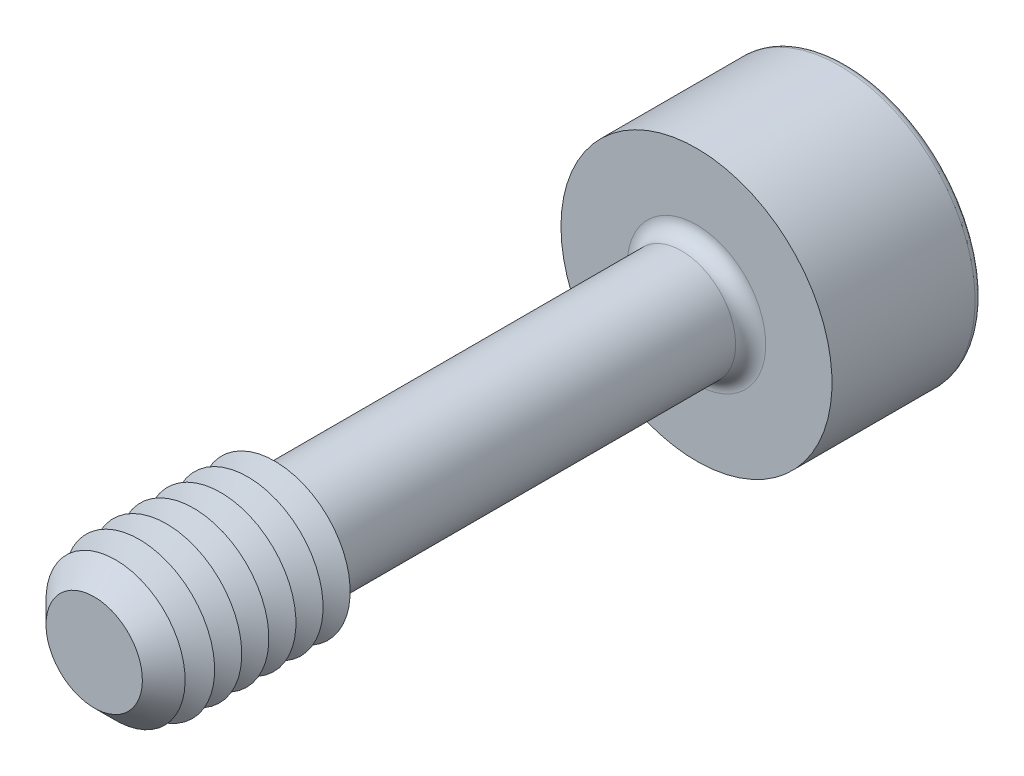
ISO-10303-21;
HEADER;
FILE_DESCRIPTION(('STEP AP214'),'2;1');
FILE_NAME('part.step','',(''),(''),'','','');
FILE_SCHEMA(('AUTOMOTIVE_DESIGN { 1 0 10303 214 1 1 1 1 }'));
ENDSEC;
DATA;
#1=APPLICATION_CONTEXT('core data for automotive mechanical design processes');
#2=APPLICATION_PROTOCOL_DEFINITION('international standard','automotive_design',2000,#1);
#3=PRODUCT_CONTEXT('',#1,'mechanical');
#4=PRODUCT('Part','Part','',(#3));
#5=PRODUCT_RELATED_PRODUCT_CATEGORY('part','',(#4));
#6=PRODUCT_DEFINITION_FORMATION('','',#4);
#7=PRODUCT_DEFINITION_CONTEXT('part definition',#1,'design');
#8=PRODUCT_DEFINITION('design','',#6,#7);
#9=PRODUCT_DEFINITION_SHAPE('','',#8);
#10=(LENGTH_UNIT() NAMED_UNIT(*) SI_UNIT(.MILLI.,.METRE.));
#11=(NAMED_UNIT(*) PLANE_ANGLE_UNIT() SI_UNIT($,.RADIAN.));
#12=(NAMED_UNIT(*) SI_UNIT($,.STERADIAN.) SOLID_ANGLE_UNIT());
#13=UNCERTAINTY_MEASURE_WITH_UNIT(LENGTH_MEASURE(1.E-05),#10,'distance_accuracy_value','');
#14=(GEOMETRIC_REPRESENTATION_CONTEXT(3) GLOBAL_UNCERTAINTY_ASSIGNED_CONTEXT((#13)) GLOBAL_UNIT_ASSIGNED_CONTEXT((#10,
#11,#12)) REPRESENTATION_CONTEXT('',''));
#15=CARTESIAN_POINT('',(0.,0.,0.));
#16=DIRECTION('',(0.,0.,1.));
#17=DIRECTION('',(1.,0.,0.));
#18=AXIS2_PLACEMENT_3D('',#15,#16,#17);
#19=CARTESIAN_POINT('',(-0.577350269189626,-0.999999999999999,-5.5));
#20=DIRECTION('',(0.,0.,1.));
#21=DIRECTION('',(1.,0.,0.));
#22=AXIS2_PLACEMENT_3D('',#19,#20,#21);
#23=PLANE('',#22);
#24=DIRECTION('',(1.,0.,0.));
#25=VECTOR('',#24,1.);
#26=CARTESIAN_POINT('',(-0.577350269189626,-0.999999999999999,-5.5));
#27=LINE('',#26,#25);
#28=CARTESIAN_POINT('',(0.,-0.999999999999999,-5.5));
#29=VERTEX_POINT('',#28);
#30=CARTESIAN_POINT('',(0.577350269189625,-0.999999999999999,-5.5));
#31=VERTEX_POINT('',#30);
#32=EDGE_CURVE('E694',#29,#31,#27,.T.);
#33=ORIENTED_EDGE('',*,*,#32,.F.);
#34=CARTESIAN_POINT('',(0.,0.,-5.5));
#35=DIRECTION('',(0.,0.,1.));
#36=DIRECTION('',(0.,-1.,0.));
#37=AXIS2_PLACEMENT_3D('',#34,#35,#36);
#38=CIRCLE('',#37,1.);
#39=CARTESIAN_POINT('',(0.866025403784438,-0.499999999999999,-5.5));
#40=VERTEX_POINT('',#39);
#41=EDGE_CURVE('E53',#29,#40,#38,.T.);
#42=ORIENTED_EDGE('',*,*,#41,.T.);
#43=DIRECTION('',(0.5,0.866025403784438,0.));
#44=VECTOR('',#43,1.);
#45=CARTESIAN_POINT('',(0.577350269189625,-0.999999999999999,-5.5));
#46=LINE('',#45,#44);
#47=EDGE_CURVE('E680',#31,#40,#46,.T.);
#48=ORIENTED_EDGE('',*,*,#47,.F.);
#49=EDGE_LOOP('',(#33,#42,#48));
#50=FACE_BOUND('',#49,.T.);
#51=ADVANCED_FACE('F41',(#50),#23,.F.);
#52=CARTESIAN_POINT('',(1.15470053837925,0.,-5.5));
#53=VERTEX_POINT('',#52);
#54=EDGE_CURVE('E690',#40,#53,#46,.T.);
#55=ORIENTED_EDGE('',*,*,#54,.F.);
#56=CARTESIAN_POINT('',(0.866025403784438,0.500000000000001,-5.5));
#57=VERTEX_POINT('',#56);
#58=EDGE_CURVE('E11',#40,#57,#38,.T.);
#59=ORIENTED_EDGE('',*,*,#58,.T.);
#60=DIRECTION('',(-0.5,0.866025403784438,0.));
#61=VECTOR('',#60,1.);
#62=CARTESIAN_POINT('',(1.15470053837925,0.,-5.5));
#63=LINE('',#62,#61);
#64=EDGE_CURVE('E679',#53,#57,#63,.T.);
#65=ORIENTED_EDGE('',*,*,#64,.F.);
#66=EDGE_LOOP('',(#55,#59,#65));
#67=FACE_BOUND('',#66,.T.);
#68=ADVANCED_FACE('F133',(#67),#23,.F.);
#69=CARTESIAN_POINT('',(0.577350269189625,1.,-5.5));
#70=VERTEX_POINT('',#69);
#71=EDGE_CURVE('E674',#57,#70,#63,.T.);
#72=ORIENTED_EDGE('',*,*,#71,.F.);
#73=CARTESIAN_POINT('',(0.,1.,-5.5));
#74=VERTEX_POINT('',#73);
#75=EDGE_CURVE('E51',#57,#74,#38,.T.);
#76=ORIENTED_EDGE('',*,*,#75,.T.);
#77=DIRECTION('',(-1.,0.,0.));
#78=VECTOR('',#77,1.);
#79=CARTESIAN_POINT('',(0.577350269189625,1.,-5.5));
#80=LINE('',#79,#78);
#81=EDGE_CURVE('E177',#70,#74,#80,.T.);
#82=ORIENTED_EDGE('',*,*,#81,.F.);
#83=EDGE_LOOP('',(#72,#76,#82));
#84=FACE_BOUND('',#83,.T.);
#85=ADVANCED_FACE('F139',(#84),#23,.F.);
#86=CARTESIAN_POINT('',(-0.577350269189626,1.,-5.5));
#87=VERTEX_POINT('',#86);
#88=EDGE_CURVE('E684',#74,#87,#80,.T.);
#89=ORIENTED_EDGE('',*,*,#88,.F.);
#90=CARTESIAN_POINT('',(-0.866025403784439,0.500000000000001,-5.5));
#91=VERTEX_POINT('',#90);
#92=EDGE_CURVE('E266',#74,#91,#38,.T.);
#93=ORIENTED_EDGE('',*,*,#92,.T.);
#94=DIRECTION('',(-0.5,-0.866025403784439,0.));
#95=VECTOR('',#94,1.);
#96=CARTESIAN_POINT('',(-0.577350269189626,1.,-5.5));
#97=LINE('',#96,#95);
#98=EDGE_CURVE('E176',#87,#91,#97,.T.);
#99=ORIENTED_EDGE('',*,*,#98,.F.);
#100=EDGE_LOOP('',(#89,#93,#99));
#101=FACE_BOUND('',#100,.T.);
#102=ADVANCED_FACE('F157',(#101),#23,.F.);
#103=CARTESIAN_POINT('',(-1.15470053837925,0.,-5.5));
#104=VERTEX_POINT('',#103);
#105=EDGE_CURVE('E170',#91,#104,#97,.T.);
#106=ORIENTED_EDGE('',*,*,#105,.F.);
#107=CARTESIAN_POINT('',(-0.866025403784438,-0.5,-5.5));
#108=VERTEX_POINT('',#107);
#109=EDGE_CURVE('E172',#91,#108,#38,.T.);
#110=ORIENTED_EDGE('',*,*,#109,.T.);
#111=DIRECTION('',(0.500000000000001,-0.866025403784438,0.));
#112=VECTOR('',#111,1.);
#113=CARTESIAN_POINT('',(-1.15470053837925,0.,-5.5));
#114=LINE('',#113,#112);
#115=EDGE_CURVE('E174',#104,#108,#114,.T.);
#116=ORIENTED_EDGE('',*,*,#115,.F.);
#117=EDGE_LOOP('',(#106,#110,#116));
#118=FACE_BOUND('',#117,.T.);
#119=ADVANCED_FACE('F146',(#118),#23,.F.);
#120=CARTESIAN_POINT('',(0.,0.,-7.5));
#121=DIRECTION('',(0.,0.,-1.));
#122=DIRECTION('',(-1.,0.,0.));
#123=AXIS2_PLACEMENT_3D('',#120,#121,#122);
#124=PLANE('',#123);
#125=CARTESIAN_POINT('',(0.,0.,-7.5));
#126=DIRECTION('',(0.,0.,-1.));
#127=DIRECTION('',(-1.,0.,0.));
#128=AXIS2_PLACEMENT_3D('',#125,#126,#127);
#129=CIRCLE('',#128,2.125);
#130=CARTESIAN_POINT('',(-2.125,0.,-7.5));
#131=VERTEX_POINT('',#130);
#132=EDGE_CURVE('E251',#131,#131,#129,.T.);
#133=ORIENTED_EDGE('',*,*,#132,.T.);
#134=EDGE_LOOP('',(#133));
#135=FACE_BOUND('',#134,.T.);
#136=DIRECTION('',(-0.5,-0.866025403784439,0.));
#137=VECTOR('',#136,1.);
#138=CARTESIAN_POINT('',(-0.577350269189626,1.,-7.5));
#139=LINE('',#138,#137);
#140=CARTESIAN_POINT('',(-0.577350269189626,1.,-7.5));
#141=VERTEX_POINT('',#140);
#142=CARTESIAN_POINT('',(-1.15470053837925,0.,-7.5));
#143=VERTEX_POINT('',#142);
#144=EDGE_CURVE('E212',#141,#143,#139,.T.);
#145=ORIENTED_EDGE('',*,*,#144,.T.);
#146=DIRECTION('',(0.500000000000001,-0.866025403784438,0.));
#147=VECTOR('',#146,1.);
#148=CARTESIAN_POINT('',(-1.15470053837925,0.,-7.5));
#149=LINE('',#148,#147);
#150=CARTESIAN_POINT('',(-0.577350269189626,-0.999999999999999,-7.5));
#151=VERTEX_POINT('',#150);
#152=EDGE_CURVE('E67',#143,#151,#149,.T.);
#153=ORIENTED_EDGE('',*,*,#152,.T.);
#154=DIRECTION('',(1.,0.,0.));
#155=VECTOR('',#154,1.);
#156=CARTESIAN_POINT('',(-0.577350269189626,-0.999999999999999,-7.5));
#157=LINE('',#156,#155);
#158=CARTESIAN_POINT('',(0.577350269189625,-0.999999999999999,-7.5));
#159=VERTEX_POINT('',#158);
#160=EDGE_CURVE('E196',#151,#159,#157,.T.);
#161=ORIENTED_EDGE('',*,*,#160,.T.);
#162=DIRECTION('',(0.5,0.866025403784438,0.));
#163=VECTOR('',#162,1.);
#164=CARTESIAN_POINT('',(0.577350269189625,-0.999999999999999,-7.5));
#165=LINE('',#164,#163);
#166=CARTESIAN_POINT('',(1.15470053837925,0.,-7.5));
#167=VERTEX_POINT('',#166);
#168=EDGE_CURVE('E200',#159,#167,#165,.T.);
#169=ORIENTED_EDGE('',*,*,#168,.T.);
#170=DIRECTION('',(-0.5,0.866025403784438,0.));
#171=VECTOR('',#170,1.);
#172=CARTESIAN_POINT('',(1.15470053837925,0.,-7.5));
#173=LINE('',#172,#171);
#174=CARTESIAN_POINT('',(0.577350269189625,1.,-7.5));
#175=VERTEX_POINT('',#174);
#176=EDGE_CURVE('E204',#167,#175,#173,.T.);
#177=ORIENTED_EDGE('',*,*,#176,.T.);
#178=DIRECTION('',(-1.,0.,0.));
#179=VECTOR('',#178,1.);
#180=CARTESIAN_POINT('',(0.577350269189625,1.,-7.5));
#181=LINE('',#180,#179);
#182=EDGE_CURVE('E208',#175,#141,#181,.T.);
#183=ORIENTED_EDGE('',*,*,#182,.T.);
#184=EDGE_LOOP('',(#145,#153,#161,#169,#177,#183));
#185=FACE_BOUND('',#184,.T.);
#186=ADVANCED_FACE('F156',(#135,#185),#124,.T.);
#187=CARTESIAN_POINT('',(0.,0.,5.));
#188=DIRECTION('',(0.,0.,-1.));
#189=DIRECTION('',(-1.,0.,0.));
#190=AXIS2_PLACEMENT_3D('',#187,#188,#189);
#191=CYLINDRICAL_SURFACE('',#190,0.9);
#192=CARTESIAN_POINT('',(0.,0.,-4.75));
#193=DIRECTION('',(0.,0.,-1.));
#194=DIRECTION('',(-1.,0.,0.));
#195=AXIS2_PLACEMENT_3D('',#192,#193,#194);
#196=CIRCLE('',#195,0.9);
#197=CARTESIAN_POINT('',(-0.9,0.,-4.75));
#198=VERTEX_POINT('',#197);
#199=EDGE_CURVE('E247',#198,#198,#196,.F.);
#200=ORIENTED_EDGE('',*,*,#199,.T.);
#201=EDGE_LOOP('',(#200));
#202=FACE_BOUND('',#201,.T.);
#203=CARTESIAN_POINT('',(0.,0.,1.79792740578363));
#204=DIRECTION('',(0.,0.,-1.));
#205=DIRECTION('',(0.,1.,0.));
#206=AXIS2_PLACEMENT_3D('',#203,#204,#205);
#207=CIRCLE('',#206,0.9);
#208=CARTESIAN_POINT('',(0.,0.9,1.79792740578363));
#209=VERTEX_POINT('',#208);
#210=EDGE_CURVE('E235',#209,#209,#207,.T.);
#211=ORIENTED_EDGE('',*,*,#210,.T.);
#212=EDGE_LOOP('',(#211));
#213=FACE_BOUND('',#212,.T.);
#214=ADVANCED_FACE('F163',(#202,#213),#191,.T.);
#215=CARTESIAN_POINT('',(0.,0.,1.79792740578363));
#216=DIRECTION('',(0.,0.,1.));
#217=DIRECTION('',(0.,-1.,0.));
#218=AXIS2_PLACEMENT_3D('',#215,#216,#217);
#219=CONICAL_SURFACE('',#218,0.9,1.0471975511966);
#220=CARTESIAN_POINT('',(0.,0.,2.));
#221=DIRECTION('',(0.,0.,-1.));
#222=DIRECTION('',(-1.,0.,0.));
#223=AXIS2_PLACEMENT_3D('',#220,#221,#222);
#224=CIRCLE('',#223,1.25);
#225=CARTESIAN_POINT('',(-1.25,0.,2.));
#226=VERTEX_POINT('',#225);
#227=EDGE_CURVE('E269',#226,#226,#224,.T.);
#228=ORIENTED_EDGE('',*,*,#227,.T.);
#229=EDGE_LOOP('',(#228));
#230=FACE_BOUND('',#229,.T.);
#231=ORIENTED_EDGE('',*,*,#210,.F.);
#232=EDGE_LOOP('',(#231));
#233=FACE_BOUND('',#232,.T.);
#234=ADVANCED_FACE('F459',(#230,#233),#219,.T.);
#235=CARTESIAN_POINT('',(0.,0.,-5.));
#236=DIRECTION('',(0.,0.,-1.));
#237=DIRECTION('',(-1.,0.,0.));
#238=AXIS2_PLACEMENT_3D('',#235,#236,#237);
#239=PLANE('',#238);
#240=CARTESIAN_POINT('',(0.,0.,-5.));
#241=DIRECTION('',(0.,0.,-1.));
#242=DIRECTION('',(-1.,0.,0.));
#243=AXIS2_PLACEMENT_3D('',#240,#241,#242);
#244=CIRCLE('',#243,1.15);
#245=CARTESIAN_POINT('',(-1.15,0.,-5.));
#246=VERTEX_POINT('',#245);
#247=EDGE_CURVE('E243',#246,#246,#244,.T.);
#248=ORIENTED_EDGE('',*,*,#247,.T.);
#249=EDGE_LOOP('',(#248));
#250=FACE_BOUND('',#249,.T.);
#251=CARTESIAN_POINT('',(0.,0.,-5.));
#252=DIRECTION('',(0.,0.,-1.));
#253=DIRECTION('',(-1.,0.,0.));
#254=AXIS2_PLACEMENT_3D('',#251,#252,#253);
#255=CIRCLE('',#254,2.25);
#256=CARTESIAN_POINT('',(-2.25,0.,-5.));
#257=VERTEX_POINT('',#256);
#258=EDGE_CURVE('E231',#257,#257,#255,.T.);
#259=ORIENTED_EDGE('',*,*,#258,.F.);
#260=EDGE_LOOP('',(#259));
#261=FACE_BOUND('',#260,.T.);
#262=ADVANCED_FACE('F452',(#250,#261),#239,.F.);
#263=CARTESIAN_POINT('',(0.,0.,-7.5));
#264=DIRECTION('',(0.,0.,1.));
#265=DIRECTION('',(1.,0.,0.));
#266=AXIS2_PLACEMENT_3D('',#263,#264,#265);
#267=CYLINDRICAL_SURFACE('',#266,2.25);
#268=CARTESIAN_POINT('',(0.,0.,-7.375));
#269=DIRECTION('',(0.,0.,-1.));
#270=DIRECTION('',(-1.,0.,0.));
#271=AXIS2_PLACEMENT_3D('',#268,#269,#270);
#272=CIRCLE('',#271,2.25);
#273=CARTESIAN_POINT('',(-2.25,0.,-7.375));
#274=VERTEX_POINT('',#273);
#275=EDGE_CURVE('E254',#274,#274,#272,.F.);
#276=ORIENTED_EDGE('',*,*,#275,.T.);
#277=EDGE_LOOP('',(#276));
#278=FACE_BOUND('',#277,.T.);
#279=ORIENTED_EDGE('',*,*,#258,.T.);
#280=EDGE_LOOP('',(#279));
#281=FACE_BOUND('',#280,.T.);
#282=ADVANCED_FACE('F458',(#278,#281),#267,.T.);
#283=CARTESIAN_POINT('',(-1.15470053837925,0.,-5.5));
#284=DIRECTION('',(0.866025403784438,0.500000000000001,0.));
#285=DIRECTION('',(-0.500000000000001,0.866025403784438,0.));
#286=AXIS2_PLACEMENT_3D('',#283,#284,#285);
#287=PLANE('',#286);
#288=ORIENTED_EDGE('',*,*,#152,.F.);
#289=DIRECTION('',(0.,0.,-1.));
#290=VECTOR('',#289,1.);
#291=CARTESIAN_POINT('',(-1.15470053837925,0.,-5.5));
#292=LINE('',#291,#290);
#293=EDGE_CURVE('E186',#104,#143,#292,.T.);
#294=ORIENTED_EDGE('',*,*,#293,.F.);
#295=ORIENTED_EDGE('',*,*,#115,.T.);
#296=CARTESIAN_POINT('',(-0.577350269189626,-0.999999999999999,-5.5));
#297=VERTEX_POINT('',#296);
#298=EDGE_CURVE('E215',#108,#297,#114,.T.);
#299=ORIENTED_EDGE('',*,*,#298,.T.);
#300=DIRECTION('',(0.,0.,-1.));
#301=VECTOR('',#300,1.);
#302=CARTESIAN_POINT('',(-0.577350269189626,-0.999999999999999,-5.5));
#303=LINE('',#302,#301);
#304=EDGE_CURVE('E228',#297,#151,#303,.T.);
#305=ORIENTED_EDGE('',*,*,#304,.T.);
#306=EDGE_LOOP('',(#288,#294,#295,#299,#305));
#307=FACE_BOUND('',#306,.T.);
#308=ADVANCED_FACE('F470',(#307),#287,.T.);
#309=CARTESIAN_POINT('',(-0.577350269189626,-0.999999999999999,-5.5));
#310=DIRECTION('',(0.,1.,0.));
#311=DIRECTION('',(-1.,0.,0.));
#312=AXIS2_PLACEMENT_3D('',#309,#310,#311);
#313=PLANE('',#312);
#314=ORIENTED_EDGE('',*,*,#160,.F.);
#315=ORIENTED_EDGE('',*,*,#304,.F.);
#316=EDGE_CURVE('E691',#297,#29,#27,.T.);
#317=ORIENTED_EDGE('',*,*,#316,.T.);
#318=ORIENTED_EDGE('',*,*,#32,.T.);
#319=DIRECTION('',(0.,0.,-1.));
#320=VECTOR('',#319,1.);
#321=CARTESIAN_POINT('',(0.577350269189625,-0.999999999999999,-5.5));
#322=LINE('',#321,#320);
#323=EDGE_CURVE('E225',#31,#159,#322,.T.);
#324=ORIENTED_EDGE('',*,*,#323,.T.);
#325=EDGE_LOOP('',(#314,#315,#317,#318,#324));
#326=FACE_BOUND('',#325,.T.);
#327=ADVANCED_FACE('F486',(#326),#313,.T.);
#328=CARTESIAN_POINT('',(0.577350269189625,-0.999999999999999,-5.5));
#329=DIRECTION('',(-0.866025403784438,0.5,0.));
#330=DIRECTION('',(-0.5,-0.866025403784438,0.));
#331=AXIS2_PLACEMENT_3D('',#328,#329,#330);
#332=PLANE('',#331);
#333=ORIENTED_EDGE('',*,*,#168,.F.);
#334=ORIENTED_EDGE('',*,*,#323,.F.);
#335=ORIENTED_EDGE('',*,*,#47,.T.);
#336=ORIENTED_EDGE('',*,*,#54,.T.);
#337=DIRECTION('',(0.,0.,-1.));
#338=VECTOR('',#337,1.);
#339=CARTESIAN_POINT('',(1.15470053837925,0.,-5.5));
#340=LINE('',#339,#338);
#341=EDGE_CURVE('E222',#53,#167,#340,.T.);
#342=ORIENTED_EDGE('',*,*,#341,.T.);
#343=EDGE_LOOP('',(#333,#334,#335,#336,#342));
#344=FACE_BOUND('',#343,.T.);
#345=ADVANCED_FACE('F496',(#344),#332,.T.);
#346=CARTESIAN_POINT('',(1.15470053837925,0.,-5.5));
#347=DIRECTION('',(-0.866025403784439,-0.5,0.));
#348=DIRECTION('',(0.5,-0.866025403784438,0.));
#349=AXIS2_PLACEMENT_3D('',#346,#347,#348);
#350=PLANE('',#349);
#351=ORIENTED_EDGE('',*,*,#176,.F.);
#352=ORIENTED_EDGE('',*,*,#341,.F.);
#353=ORIENTED_EDGE('',*,*,#64,.T.);
#354=ORIENTED_EDGE('',*,*,#71,.T.);
#355=DIRECTION('',(0.,0.,-1.));
#356=VECTOR('',#355,1.);
#357=CARTESIAN_POINT('',(0.577350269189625,1.,-5.5));
#358=LINE('',#357,#356);
#359=EDGE_CURVE('E219',#70,#175,#358,.T.);
#360=ORIENTED_EDGE('',*,*,#359,.T.);
#361=EDGE_LOOP('',(#351,#352,#353,#354,#360));
#362=FACE_BOUND('',#361,.T.);
#363=ADVANCED_FACE('F506',(#362),#350,.T.);
#364=CARTESIAN_POINT('',(0.577350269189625,1.,-5.5));
#365=DIRECTION('',(0.,-1.,0.));
#366=DIRECTION('',(1.,0.,0.));
#367=AXIS2_PLACEMENT_3D('',#364,#365,#366);
#368=PLANE('',#367);
#369=ORIENTED_EDGE('',*,*,#182,.F.);
#370=ORIENTED_EDGE('',*,*,#359,.F.);
#371=ORIENTED_EDGE('',*,*,#81,.T.);
#372=ORIENTED_EDGE('',*,*,#88,.T.);
#373=DIRECTION('',(0.,0.,-1.));
#374=VECTOR('',#373,1.);
#375=CARTESIAN_POINT('',(-0.577350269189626,1.,-5.5));
#376=LINE('',#375,#374);
#377=EDGE_CURVE('E182',#87,#141,#376,.T.);
#378=ORIENTED_EDGE('',*,*,#377,.T.);
#379=EDGE_LOOP('',(#369,#370,#371,#372,#378));
#380=FACE_BOUND('',#379,.T.);
#381=ADVANCED_FACE('F152',(#380),#368,.T.);
#382=CARTESIAN_POINT('',(-0.577350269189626,1.,-5.5));
#383=DIRECTION('',(0.866025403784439,-0.5,0.));
#384=DIRECTION('',(0.5,0.866025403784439,0.));
#385=AXIS2_PLACEMENT_3D('',#382,#383,#384);
#386=PLANE('',#385);
#387=ORIENTED_EDGE('',*,*,#144,.F.);
#388=ORIENTED_EDGE('',*,*,#377,.F.);
#389=ORIENTED_EDGE('',*,*,#98,.T.);
#390=ORIENTED_EDGE('',*,*,#105,.T.);
#391=ORIENTED_EDGE('',*,*,#293,.T.);
#392=EDGE_LOOP('',(#387,#388,#389,#390,#391));
#393=FACE_BOUND('',#392,.T.);
#394=ADVANCED_FACE('F144',(#393),#386,.T.);
#395=ORIENTED_EDGE('',*,*,#298,.F.);
#396=EDGE_CURVE('E257',#108,#29,#38,.T.);
#397=ORIENTED_EDGE('',*,*,#396,.T.);
#398=ORIENTED_EDGE('',*,*,#316,.F.);
#399=EDGE_LOOP('',(#395,#397,#398));
#400=FACE_BOUND('',#399,.T.);
#401=ADVANCED_FACE('F135',(#400),#23,.F.);
#402=CARTESIAN_POINT('',(0.,0.,-4.75));
#403=DIRECTION('',(0.,0.,-1.));
#404=DIRECTION('',(-1.,0.,0.));
#405=AXIS2_PLACEMENT_3D('',#402,#403,#404);
#406=TOROIDAL_SURFACE('',#405,1.15,0.25);
#407=ORIENTED_EDGE('',*,*,#199,.F.);
#408=EDGE_LOOP('',(#407));
#409=FACE_BOUND('',#408,.T.);
#410=ORIENTED_EDGE('',*,*,#247,.F.);
#411=EDGE_LOOP('',(#410));
#412=FACE_BOUND('',#411,.T.);
#413=ADVANCED_FACE('F129',(#409,#412),#406,.F.);
#414=CARTESIAN_POINT('',(0.,0.,-7.375));
#415=DIRECTION('',(0.,0.,-1.));
#416=DIRECTION('',(-1.,0.,0.));
#417=AXIS2_PLACEMENT_3D('',#414,#415,#416);
#418=TOROIDAL_SURFACE('',#417,2.125,0.125);
#419=ORIENTED_EDGE('',*,*,#275,.F.);
#420=EDGE_LOOP('',(#419));
#421=FACE_BOUND('',#420,.T.);
#422=ORIENTED_EDGE('',*,*,#132,.F.);
#423=EDGE_LOOP('',(#422));
#424=FACE_BOUND('',#423,.T.);
#425=ADVANCED_FACE('F43',(#421,#424),#418,.T.);
#426=CARTESIAN_POINT('',(0.,0.,-4.92264973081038));
#427=DIRECTION('',(0.,0.,-1.));
#428=DIRECTION('',(0.,1.,0.));
#429=AXIS2_PLACEMENT_3D('',#426,#427,#428);
#430=CONICAL_SURFACE('',#429,0.,1.04719755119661);
#431=ORIENTED_EDGE('',*,*,#41,.F.);
#432=ORIENTED_EDGE('',*,*,#396,.F.);
#433=ORIENTED_EDGE('',*,*,#109,.F.);
#434=ORIENTED_EDGE('',*,*,#92,.F.);
#435=ORIENTED_EDGE('',*,*,#75,.F.);
#436=ORIENTED_EDGE('',*,*,#58,.F.);
#437=EDGE_LOOP('',(#431,#432,#433,#434,#435,#436));
#438=FACE_BOUND('',#437,.T.);
#439=CARTESIAN_POINT('',(0.,0.,-4.92264973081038));
#440=VERTEX_POINT('',#439);
#441=VERTEX_LOOP('',#440);
#442=FACE_BOUND('',#441,.T.);
#443=ADVANCED_FACE('F118',(#438,#442),#430,.F.);
#444=CARTESIAN_POINT('',(0.,0.,2.225));
#445=DIRECTION('',(0.,0.,-1.));
#446=DIRECTION('',(-1.,0.,0.));
#447=AXIS2_PLACEMENT_3D('',#444,#445,#446);
#448=CONICAL_SURFACE('',#447,0.860288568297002,1.0471975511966);
#449=ORIENTED_EDGE('',*,*,#227,.F.);
#450=EDGE_LOOP('',(#449));
#451=FACE_BOUND('',#450,.T.);
#452=CARTESIAN_POINT('',(0.,0.,2.225));
#453=DIRECTION('',(0.,0.,-1.));
#454=DIRECTION('',(-1.,0.,0.));
#455=AXIS2_PLACEMENT_3D('',#452,#453,#454);
#456=CIRCLE('',#455,0.860288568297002);
#457=CARTESIAN_POINT('',(-0.860288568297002,0.,2.225));
#458=VERTEX_POINT('',#457);
#459=EDGE_CURVE('E274',#458,#458,#456,.T.);
#460=ORIENTED_EDGE('',*,*,#459,.T.);
#461=EDGE_LOOP('',(#460));
#462=FACE_BOUND('',#461,.T.);
#463=ADVANCED_FACE('F120',(#451,#462),#448,.T.);
#464=CARTESIAN_POINT('',(0.,0.,2.45));
#465=DIRECTION('',(0.,0.,1.));
#466=DIRECTION('',(1.,0.,0.));
#467=AXIS2_PLACEMENT_3D('',#464,#465,#466);
#468=CONICAL_SURFACE('',#467,1.25,1.0471975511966);
#469=ORIENTED_EDGE('',*,*,#459,.F.);
#470=EDGE_LOOP('',(#469));
#471=FACE_BOUND('',#470,.T.);
#472=CARTESIAN_POINT('',(0.,0.,2.45));
#473=DIRECTION('',(0.,0.,-1.));
#474=DIRECTION('',(-1.,0.,0.));
#475=AXIS2_PLACEMENT_3D('',#472,#473,#474);
#476=CIRCLE('',#475,1.25);
#477=CARTESIAN_POINT('',(-1.25,0.,2.45));
#478=VERTEX_POINT('',#477);
#479=EDGE_CURVE('E280',#478,#478,#476,.T.);
#480=ORIENTED_EDGE('',*,*,#479,.T.);
#481=EDGE_LOOP('',(#480));
#482=FACE_BOUND('',#481,.T.);
#483=ADVANCED_FACE('F126',(#471,#482),#468,.T.);
#484=CARTESIAN_POINT('',(0.,0.,2.675));
#485=DIRECTION('',(0.,0.,-1.));
#486=DIRECTION('',(-1.,0.,0.));
#487=AXIS2_PLACEMENT_3D('',#484,#485,#486);
#488=CONICAL_SURFACE('',#487,0.860288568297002,1.0471975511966);
#489=ORIENTED_EDGE('',*,*,#479,.F.);
#490=EDGE_LOOP('',(#489));
#491=FACE_BOUND('',#490,.T.);
#492=CARTESIAN_POINT('',(0.,0.,2.675));
#493=DIRECTION('',(0.,0.,-1.));
#494=DIRECTION('',(-1.,0.,0.));
#495=AXIS2_PLACEMENT_3D('',#492,#493,#494);
#496=CIRCLE('',#495,0.860288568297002);
#497=CARTESIAN_POINT('',(-0.860288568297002,0.,2.675));
#498=VERTEX_POINT('',#497);
#499=EDGE_CURVE('E285',#498,#498,#496,.T.);
#500=ORIENTED_EDGE('',*,*,#499,.T.);
#501=EDGE_LOOP('',(#500));
#502=FACE_BOUND('',#501,.T.);
#503=ADVANCED_FACE('F366',(#491,#502),#488,.T.);
#504=CARTESIAN_POINT('',(0.,0.,2.9));
#505=DIRECTION('',(0.,0.,1.));
#506=DIRECTION('',(1.,0.,0.));
#507=AXIS2_PLACEMENT_3D('',#504,#505,#506);
#508=CONICAL_SURFACE('',#507,1.25,1.0471975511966);
#509=ORIENTED_EDGE('',*,*,#499,.F.);
#510=EDGE_LOOP('',(#509));
#511=FACE_BOUND('',#510,.T.);
#512=CARTESIAN_POINT('',(0.,0.,2.9));
#513=DIRECTION('',(0.,0.,-1.));
#514=DIRECTION('',(-1.,0.,0.));
#515=AXIS2_PLACEMENT_3D('',#512,#513,#514);
#516=CIRCLE('',#515,1.25);
#517=CARTESIAN_POINT('',(-1.25,0.,2.9));
#518=VERTEX_POINT('',#517);
#519=EDGE_CURVE('E289',#518,#518,#516,.T.);
#520=ORIENTED_EDGE('',*,*,#519,.T.);
#521=EDGE_LOOP('',(#520));
#522=FACE_BOUND('',#521,.T.);
#523=ADVANCED_FACE('F362',(#511,#522),#508,.T.);
#524=CARTESIAN_POINT('',(0.,0.,3.125));
#525=DIRECTION('',(0.,0.,-1.));
#526=DIRECTION('',(-1.,0.,0.));
#527=AXIS2_PLACEMENT_3D('',#524,#525,#526);
#528=CONICAL_SURFACE('',#527,0.860288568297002,1.0471975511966);
#529=ORIENTED_EDGE('',*,*,#519,.F.);
#530=EDGE_LOOP('',(#529));
#531=FACE_BOUND('',#530,.T.);
#532=CARTESIAN_POINT('',(0.,0.,3.125));
#533=DIRECTION('',(0.,0.,-1.));
#534=DIRECTION('',(-1.,0.,0.));
#535=AXIS2_PLACEMENT_3D('',#532,#533,#534);
#536=CIRCLE('',#535,0.860288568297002);
#537=CARTESIAN_POINT('',(-0.860288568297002,0.,3.125));
#538=VERTEX_POINT('',#537);
#539=EDGE_CURVE('E292',#538,#538,#536,.T.);
#540=ORIENTED_EDGE('',*,*,#539,.T.);
#541=EDGE_LOOP('',(#540));
#542=FACE_BOUND('',#541,.T.);
#543=ADVANCED_FACE('F358',(#531,#542),#528,.T.);
#544=CARTESIAN_POINT('',(0.,0.,3.35));
#545=DIRECTION('',(0.,0.,1.));
#546=DIRECTION('',(1.,0.,0.));
#547=AXIS2_PLACEMENT_3D('',#544,#545,#546);
#548=CONICAL_SURFACE('',#547,1.25,1.0471975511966);
#549=ORIENTED_EDGE('',*,*,#539,.F.);
#550=EDGE_LOOP('',(#549));
#551=FACE_BOUND('',#550,.T.);
#552=CARTESIAN_POINT('',(0.,0.,3.35));
#553=DIRECTION('',(0.,0.,-1.));
#554=DIRECTION('',(-1.,0.,0.));
#555=AXIS2_PLACEMENT_3D('',#552,#553,#554);
#556=CIRCLE('',#555,1.25);
#557=CARTESIAN_POINT('',(-1.25,0.,3.35));
#558=VERTEX_POINT('',#557);
#559=EDGE_CURVE('E296',#558,#558,#556,.T.);
#560=ORIENTED_EDGE('',*,*,#559,.T.);
#561=EDGE_LOOP('',(#560));
#562=FACE_BOUND('',#561,.T.);
#563=ADVANCED_FACE('F354',(#551,#562),#548,.T.);
#564=CARTESIAN_POINT('',(0.,0.,3.575));
#565=DIRECTION('',(0.,0.,-1.));
#566=DIRECTION('',(-1.,0.,0.));
#567=AXIS2_PLACEMENT_3D('',#564,#565,#566);
#568=CONICAL_SURFACE('',#567,0.860288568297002,1.0471975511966);
#569=ORIENTED_EDGE('',*,*,#559,.F.);
#570=EDGE_LOOP('',(#569));
#571=FACE_BOUND('',#570,.T.);
#572=CARTESIAN_POINT('',(0.,0.,3.575));
#573=DIRECTION('',(0.,0.,-1.));
#574=DIRECTION('',(-1.,0.,0.));
#575=AXIS2_PLACEMENT_3D('',#572,#573,#574);
#576=CIRCLE('',#575,0.860288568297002);
#577=CARTESIAN_POINT('',(-0.860288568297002,0.,3.575));
#578=VERTEX_POINT('',#577);
#579=EDGE_CURVE('E300',#578,#578,#576,.T.);
#580=ORIENTED_EDGE('',*,*,#579,.T.);
#581=EDGE_LOOP('',(#580));
#582=FACE_BOUND('',#581,.T.);
#583=ADVANCED_FACE('F350',(#571,#582),#568,.T.);
#584=CARTESIAN_POINT('',(0.,0.,3.8));
#585=DIRECTION('',(0.,0.,1.));
#586=DIRECTION('',(1.,0.,0.));
#587=AXIS2_PLACEMENT_3D('',#584,#585,#586);
#588=CONICAL_SURFACE('',#587,1.25,1.0471975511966);
#589=ORIENTED_EDGE('',*,*,#579,.F.);
#590=EDGE_LOOP('',(#589));
#591=FACE_BOUND('',#590,.T.);
#592=CARTESIAN_POINT('',(0.,0.,3.8));
#593=DIRECTION('',(0.,0.,-1.));
#594=DIRECTION('',(-1.,0.,0.));
#595=AXIS2_PLACEMENT_3D('',#592,#593,#594);
#596=CIRCLE('',#595,1.25);
#597=CARTESIAN_POINT('',(-1.25,0.,3.8));
#598=VERTEX_POINT('',#597);
#599=EDGE_CURVE('E304',#598,#598,#596,.T.);
#600=ORIENTED_EDGE('',*,*,#599,.T.);
#601=EDGE_LOOP('',(#600));
#602=FACE_BOUND('',#601,.T.);
#603=ADVANCED_FACE('F346',(#591,#602),#588,.T.);
#604=CARTESIAN_POINT('',(0.,0.,4.025));
#605=DIRECTION('',(0.,0.,-1.));
#606=DIRECTION('',(-1.,0.,0.));
#607=AXIS2_PLACEMENT_3D('',#604,#605,#606);
#608=CONICAL_SURFACE('',#607,0.860288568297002,1.0471975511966);
#609=ORIENTED_EDGE('',*,*,#599,.F.);
#610=EDGE_LOOP('',(#609));
#611=FACE_BOUND('',#610,.T.);
#612=CARTESIAN_POINT('',(0.,0.,4.025));
#613=DIRECTION('',(0.,0.,-1.));
#614=DIRECTION('',(-1.,0.,0.));
#615=AXIS2_PLACEMENT_3D('',#612,#613,#614);
#616=CIRCLE('',#615,0.860288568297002);
#617=CARTESIAN_POINT('',(-0.860288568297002,0.,4.025));
#618=VERTEX_POINT('',#617);
#619=EDGE_CURVE('E308',#618,#618,#616,.T.);
#620=ORIENTED_EDGE('',*,*,#619,.T.);
#621=EDGE_LOOP('',(#620));
#622=FACE_BOUND('',#621,.T.);
#623=ADVANCED_FACE('F342',(#611,#622),#608,.T.);
#624=CARTESIAN_POINT('',(0.,0.,4.25));
#625=DIRECTION('',(0.,0.,1.));
#626=DIRECTION('',(1.,0.,0.));
#627=AXIS2_PLACEMENT_3D('',#624,#625,#626);
#628=CONICAL_SURFACE('',#627,1.25,1.0471975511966);
#629=ORIENTED_EDGE('',*,*,#619,.F.);
#630=EDGE_LOOP('',(#629));
#631=FACE_BOUND('',#630,.T.);
#632=CARTESIAN_POINT('',(0.,0.,4.25));
#633=DIRECTION('',(0.,0.,-1.));
#634=DIRECTION('',(-1.,0.,0.));
#635=AXIS2_PLACEMENT_3D('',#632,#633,#634);
#636=CIRCLE('',#635,1.25);
#637=CARTESIAN_POINT('',(-1.25,0.,4.25));
#638=VERTEX_POINT('',#637);
#639=EDGE_CURVE('E312',#638,#638,#636,.T.);
#640=ORIENTED_EDGE('',*,*,#639,.T.);
#641=EDGE_LOOP('',(#640));
#642=FACE_BOUND('',#641,.T.);
#643=ADVANCED_FACE('F335',(#631,#642),#628,.T.);
#644=CARTESIAN_POINT('',(0.,0.,4.475));
#645=DIRECTION('',(0.,0.,-1.));
#646=DIRECTION('',(-1.,0.,0.));
#647=AXIS2_PLACEMENT_3D('',#644,#645,#646);
#648=CONICAL_SURFACE('',#647,0.860288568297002,1.0471975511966);
#649=ORIENTED_EDGE('',*,*,#639,.F.);
#650=EDGE_LOOP('',(#649));
#651=FACE_BOUND('',#650,.T.);
#652=CARTESIAN_POINT('',(0.,0.,4.475));
#653=DIRECTION('',(0.,0.,-1.));
#654=DIRECTION('',(-1.,0.,0.));
#655=AXIS2_PLACEMENT_3D('',#652,#653,#654);
#656=CIRCLE('',#655,0.860288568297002);
#657=CARTESIAN_POINT('',(-0.860288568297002,0.,4.475));
#658=VERTEX_POINT('',#657);
#659=EDGE_CURVE('E316',#658,#658,#656,.T.);
#660=ORIENTED_EDGE('',*,*,#659,.T.);
#661=EDGE_LOOP('',(#660));
#662=FACE_BOUND('',#661,.T.);
#663=ADVANCED_FACE('F321',(#651,#662),#648,.T.);
#664=CARTESIAN_POINT('',(0.,0.,4.7));
#665=DIRECTION('',(0.,0.,1.));
#666=DIRECTION('',(1.,0.,0.));
#667=AXIS2_PLACEMENT_3D('',#664,#665,#666);
#668=CONICAL_SURFACE('',#667,1.25,1.0471975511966);
#669=CARTESIAN_POINT('',(0.,0.,4.64509618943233));
#670=DIRECTION('',(0.,0.,1.));
#671=DIRECTION('',(1.,0.,0.));
#672=AXIS2_PLACEMENT_3D('',#669,#670,#671);
#673=CIRCLE('',#672,1.15490381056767);
#674=CARTESIAN_POINT('',(0.,1.15490381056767,4.64509618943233));
#675=VERTEX_POINT('',#674);
#676=EDGE_CURVE('E45',#675,#675,#673,.F.);
#677=ORIENTED_EDGE('',*,*,#676,.T.);
#678=EDGE_LOOP('',(#677));
#679=FACE_BOUND('',#678,.T.);
#680=ORIENTED_EDGE('',*,*,#659,.F.);
#681=EDGE_LOOP('',(#680));
#682=FACE_BOUND('',#681,.T.);
#683=ADVANCED_FACE('F323',(#679,#682),#668,.T.);
#684=CARTESIAN_POINT('',(0.,0.,5.));
#685=DIRECTION('',(0.,0.,1.));
#686=DIRECTION('',(1.,0.,0.));
#687=AXIS2_PLACEMENT_3D('',#684,#685,#686);
#688=PLANE('',#687);
#689=CARTESIAN_POINT('',(0.,0.,5.));
#690=DIRECTION('',(0.,0.,1.));
#691=DIRECTION('',(1.,0.,0.));
#692=AXIS2_PLACEMENT_3D('',#689,#690,#691);
#693=CIRCLE('',#692,0.799999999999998);
#694=CARTESIAN_POINT('',(0.,0.799999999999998,5.));
#695=VERTEX_POINT('',#694);
#696=EDGE_CURVE('E239',#695,#695,#693,.T.);
#697=ORIENTED_EDGE('',*,*,#696,.T.);
#698=EDGE_LOOP('',(#697));
#699=FACE_BOUND('',#698,.T.);
#700=ADVANCED_FACE('F325',(#699),#688,.T.);
#701=CARTESIAN_POINT('',(0.,0.,4.55));
#702=DIRECTION('',(0.,0.,-1.));
#703=DIRECTION('',(0.,1.,0.));
#704=AXIS2_PLACEMENT_3D('',#701,#702,#703);
#705=CONICAL_SURFACE('',#704,1.25,0.785398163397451);
#706=CARTESIAN_POINT('',(0.,1.15490381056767,4.64509618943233));
#707=CARTESIAN_POINT('',(0.,1.15120689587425,4.64879310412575));
#708=CARTESIAN_POINT('',(0.,1.14750998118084,4.65249001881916));
#709=CARTESIAN_POINT('',(0.,1.14011615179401,4.65988384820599));
#710=CARTESIAN_POINT('',(0.,1.1364192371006,4.6635807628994));
#711=CARTESIAN_POINT('',(0.,1.12902540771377,4.67097459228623));
#712=CARTESIAN_POINT('',(0.,1.12532849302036,4.67467150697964));
#713=CARTESIAN_POINT('',(0.,1.11793466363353,4.68206533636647));
#714=CARTESIAN_POINT('',(0.,1.11423774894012,4.68576225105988));
#715=CARTESIAN_POINT('',(0.,1.10684391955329,4.69315608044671));
#716=CARTESIAN_POINT('',(0.,1.10314700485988,4.69685299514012));
#717=CARTESIAN_POINT('',(0.,1.09575317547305,4.70424682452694));
#718=CARTESIAN_POINT('',(0.,1.09205626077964,4.70794373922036));
#719=CARTESIAN_POINT('',(0.,1.08466243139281,4.71533756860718));
#720=CARTESIAN_POINT('',(0.,1.0809655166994,4.7190344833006));
#721=CARTESIAN_POINT('',(0.,1.07357168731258,4.72642831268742));
#722=CARTESIAN_POINT('',(0.,1.06987477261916,4.73012522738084));
#723=CARTESIAN_POINT('',(0.,1.06248094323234,4.73751905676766));
#724=CARTESIAN_POINT('',(0.,1.05878402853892,4.74121597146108));
#725=CARTESIAN_POINT('',(0.,1.0513901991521,4.7486098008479));
#726=CARTESIAN_POINT('',(0.,1.04769328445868,4.75230671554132));
#727=CARTESIAN_POINT('',(0.,1.04029945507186,4.75970054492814));
#728=CARTESIAN_POINT('',(0.,1.03660254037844,4.76339745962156));
#729=CARTESIAN_POINT('',(0.,1.02920871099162,4.77079128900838));
#730=CARTESIAN_POINT('',(0.,1.0255117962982,4.7744882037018));
#731=CARTESIAN_POINT('',(0.,1.01811796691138,4.78188203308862));
#732=CARTESIAN_POINT('',(0.,1.01442105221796,4.78557894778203));
#733=CARTESIAN_POINT('',(0.,1.00702722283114,4.79297277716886));
#734=CARTESIAN_POINT('',(0.,1.00333030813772,4.79666969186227));
#735=CARTESIAN_POINT('',(0.,0.995936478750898,4.8040635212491));
#736=CARTESIAN_POINT('',(0.,0.992239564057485,4.80776043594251));
#737=CARTESIAN_POINT('',(0.,0.984845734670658,4.81515426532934));
#738=CARTESIAN_POINT('',(0.,0.981148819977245,4.81885118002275));
#739=CARTESIAN_POINT('',(0.,0.973754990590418,4.82624500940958));
#740=CARTESIAN_POINT('',(0.,0.970058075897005,4.82994192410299));
#741=CARTESIAN_POINT('',(0.,0.962664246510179,4.83733575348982));
#742=CARTESIAN_POINT('',(0.,0.958967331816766,4.84103266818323));
#743=CARTESIAN_POINT('',(0.,0.951573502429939,4.84842649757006));
#744=CARTESIAN_POINT('',(0.,0.947876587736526,4.85212341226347));
#745=CARTESIAN_POINT('',(0.,0.9404827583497,4.8595172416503));
#746=CARTESIAN_POINT('',(0.,0.936785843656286,4.86321415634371));
#747=CARTESIAN_POINT('',(0.,0.92939201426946,4.87060798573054));
#748=CARTESIAN_POINT('',(0.,0.925695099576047,4.87430490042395));
#749=CARTESIAN_POINT('',(0.,0.91830127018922,4.88169872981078));
#750=CARTESIAN_POINT('',(0.,0.914604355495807,4.88539564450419));
#751=CARTESIAN_POINT('',(0.,0.907210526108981,4.89278947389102));
#752=CARTESIAN_POINT('',(0.,0.903513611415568,4.89648638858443));
#753=CARTESIAN_POINT('',(0.,0.896119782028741,4.90388021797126));
#754=CARTESIAN_POINT('',(0.,0.892422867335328,4.90757713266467));
#755=CARTESIAN_POINT('',(0.,0.885029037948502,4.9149709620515));
#756=CARTESIAN_POINT('',(0.,0.881332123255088,4.91866787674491));
#757=CARTESIAN_POINT('',(0.,0.873938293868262,4.92606170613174));
#758=CARTESIAN_POINT('',(0.,0.870241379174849,4.92975862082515));
#759=CARTESIAN_POINT('',(0.,0.862847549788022,4.93715245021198));
#760=CARTESIAN_POINT('',(0.,0.859150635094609,4.94084936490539));
#761=CARTESIAN_POINT('',(0.,0.851756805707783,4.94824319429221));
#762=CARTESIAN_POINT('',(0.,0.848059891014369,4.95194010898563));
#763=CARTESIAN_POINT('',(0.,0.840666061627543,4.95933393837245));
#764=CARTESIAN_POINT('',(0.,0.83696914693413,4.96303085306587));
#765=CARTESIAN_POINT('',(0.,0.829575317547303,4.97042468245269));
#766=CARTESIAN_POINT('',(0.,0.82587840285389,4.97412159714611));
#767=CARTESIAN_POINT('',(0.,0.818484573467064,4.98151542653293));
#768=CARTESIAN_POINT('',(0.,0.814787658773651,4.98521234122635));
#769=CARTESIAN_POINT('',(0.,0.807393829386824,4.99260617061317));
#770=CARTESIAN_POINT('',(0.,0.803696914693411,4.99630308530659));
#771=CARTESIAN_POINT('',(0.,0.799999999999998,5.));
#772=B_SPLINE_CURVE_WITH_KNOTS('',3,(#706,#707,#708,#709,#710,#711,#712,#713,#714,#715,#716,
#717,#718,#719,#720,#721,#722,#723,#724,#725,#726,#727,#728,#729,#730,#731,#732,#733,#734,#735,
#736,#737,#738,#739,#740,#741,#742,#743,#744,#745,#746,#747,#748,#749,#750,#751,#752,#753,#754,
#755,#756,#757,#758,#759,#760,#761,#762,#763,#764,#765,#766,#767,#768,#769,#770,#771),
.UNSPECIFIED.,.F.,.F.,(4,2,2,2,2,2,2,2,2,2,2,2,2,2,2,2,2,2,2,2,2,2,2,2,2,2,2,2,2,2,2,2,4),(0.,
0.0156846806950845,0.0313693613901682,0.0470540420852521,0.0627387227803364,0.0784234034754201,
0.094108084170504,0.109792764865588,0.125477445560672,0.141162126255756,0.15684680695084,
0.172531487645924,0.188216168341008,0.203900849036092,0.219585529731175,0.23527021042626,
0.250954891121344,0.266639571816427,0.282324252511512,0.298008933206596,0.313693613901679,
0.329378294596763,0.345062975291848,0.360747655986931,0.376432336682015,0.3921170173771,
0.407801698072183,0.423486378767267,0.439171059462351,0.454855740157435,0.470540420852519,
0.486225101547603,0.501909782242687),.UNSPECIFIED.);
#773=EDGE_CURVE('BSEAM332',#675,#695,#772,.T.);
#774=ORIENTED_EDGE('',*,*,#676,.F.);
#775=ORIENTED_EDGE('',*,*,#696,.F.);
#776=ORIENTED_EDGE('',*,*,#773,.T.);
#777=ORIENTED_EDGE('',*,*,#773,.F.);
#778=EDGE_LOOP('',(#774,#776,#775,#777));
#779=FACE_BOUND('',#778,.T.);
#780=ADVANCED_FACE('F332',(#779),#705,.T.);
#781=CLOSED_SHELL('',(#51,#68,#85,#102,#119,#186,#214,#234,#262,#282,#308,#327,#345,#363,#381,
#394,#401,#413,#425,#443,#463,#483,#503,#523,#543,#563,#583,#603,#623,#643,#663,#683,#700,#780));
#782=MANIFOLD_SOLID_BREP('B2',#781);
#783=ADVANCED_BREP_SHAPE_REPRESENTATION('',(#18,#782),#14);
#784=SHAPE_DEFINITION_REPRESENTATION(#9,#783);
ENDSEC;
END-ISO-10303-21;
